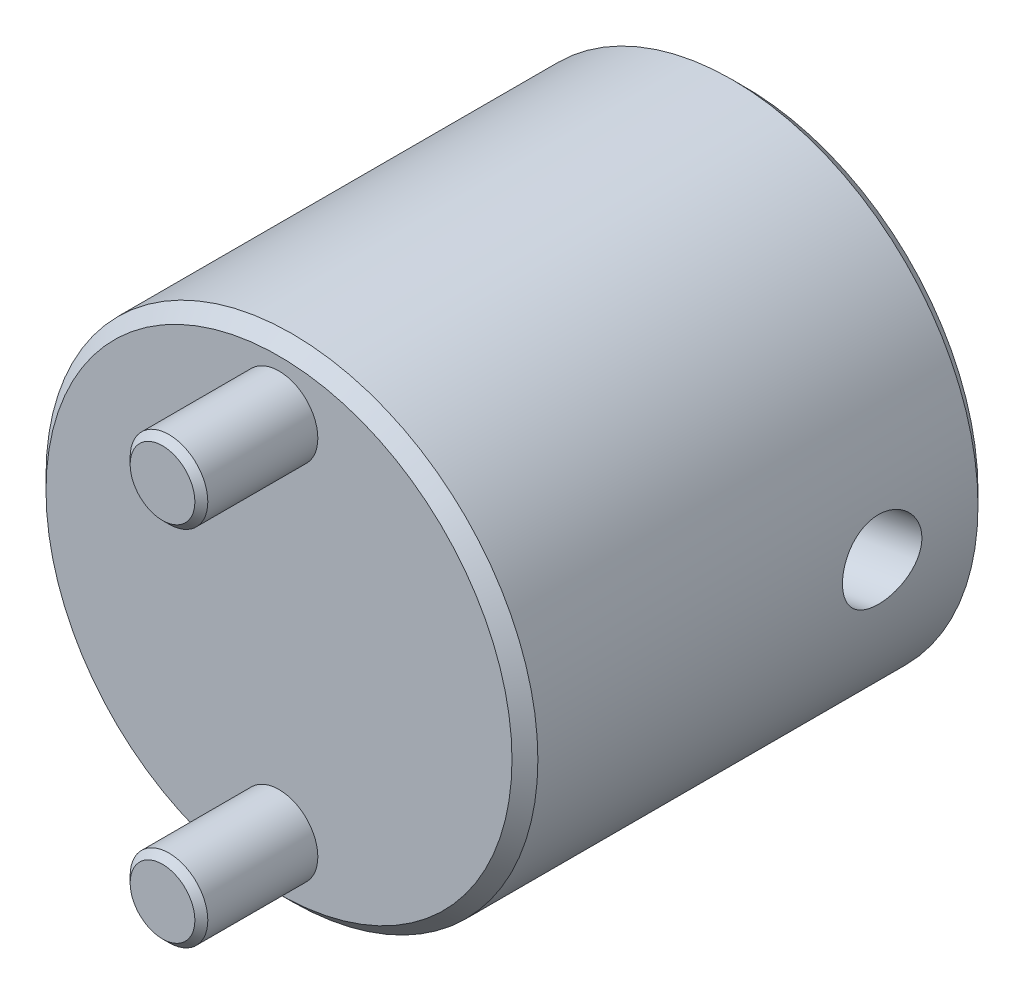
ISO-10303-21;
HEADER;
FILE_DESCRIPTION(('STEP AP214'),'2;1');
FILE_NAME('part.step','',(''),(''),'','','');
FILE_SCHEMA(('AUTOMOTIVE_DESIGN { 1 0 10303 214 1 1 1 1 }'));
ENDSEC;
DATA;
#1=APPLICATION_CONTEXT('core data for automotive mechanical design processes');
#2=APPLICATION_PROTOCOL_DEFINITION('international standard','automotive_design',2000,#1);
#3=PRODUCT_CONTEXT('',#1,'mechanical');
#4=PRODUCT('Part','Part','',(#3));
#5=PRODUCT_RELATED_PRODUCT_CATEGORY('part','',(#4));
#6=PRODUCT_DEFINITION_FORMATION('','',#4);
#7=PRODUCT_DEFINITION_CONTEXT('part definition',#1,'design');
#8=PRODUCT_DEFINITION('design','',#6,#7);
#9=PRODUCT_DEFINITION_SHAPE('','',#8);
#10=(LENGTH_UNIT() NAMED_UNIT(*) SI_UNIT(.MILLI.,.METRE.));
#11=(NAMED_UNIT(*) PLANE_ANGLE_UNIT() SI_UNIT($,.RADIAN.));
#12=(NAMED_UNIT(*) SI_UNIT($,.STERADIAN.) SOLID_ANGLE_UNIT());
#13=UNCERTAINTY_MEASURE_WITH_UNIT(LENGTH_MEASURE(1.E-05),#10,'distance_accuracy_value','');
#14=(GEOMETRIC_REPRESENTATION_CONTEXT(3) GLOBAL_UNCERTAINTY_ASSIGNED_CONTEXT((#13)) GLOBAL_UNIT_ASSIGNED_CONTEXT((#10,
#11,#12)) REPRESENTATION_CONTEXT('',''));
#15=CARTESIAN_POINT('',(0.,0.,0.));
#16=DIRECTION('',(0.,0.,1.));
#17=DIRECTION('',(1.,0.,0.));
#18=AXIS2_PLACEMENT_3D('',#15,#16,#17);
#19=CARTESIAN_POINT('',(0.,0.,9.));
#20=DIRECTION('',(0.,0.,1.));
#21=DIRECTION('',(1.,0.,0.));
#22=AXIS2_PLACEMENT_3D('',#19,#20,#21);
#23=PLANE('',#22);
#24=CARTESIAN_POINT('',(0.,14.,9.));
#25=DIRECTION('',(0.,0.,1.));
#26=DIRECTION('',(1.,0.,0.));
#27=AXIS2_PLACEMENT_3D('',#24,#25,#26);
#28=CIRCLE('',#27,2.49998893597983);
#29=CARTESIAN_POINT('',(2.49998893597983,14.,9.));
#30=VERTEX_POINT('',#29);
#31=EDGE_CURVE('E17',#30,#30,#28,.F.);
#32=ORIENTED_EDGE('',*,*,#31,.F.);
#33=EDGE_LOOP('',(#32));
#34=FACE_BOUND('',#33,.T.);
#35=ADVANCED_FACE('F14',(#34),#23,.T.);
#36=CARTESIAN_POINT('',(0.,0.,9.));
#37=DIRECTION('',(0.,0.,1.));
#38=DIRECTION('',(1.,0.,0.));
#39=AXIS2_PLACEMENT_3D('',#36,#37,#38);
#40=PLANE('',#39);
#41=CARTESIAN_POINT('',(0.,-14.,9.));
#42=DIRECTION('',(0.,0.,1.));
#43=DIRECTION('',(1.,0.,0.));
#44=AXIS2_PLACEMENT_3D('',#41,#42,#43);
#45=CIRCLE('',#44,2.49998893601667);
#46=CARTESIAN_POINT('',(2.49998893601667,-14.,9.));
#47=VERTEX_POINT('',#46);
#48=EDGE_CURVE('E114',#47,#47,#45,.F.);
#49=ORIENTED_EDGE('',*,*,#48,.F.);
#50=EDGE_LOOP('',(#49));
#51=FACE_BOUND('',#50,.T.);
#52=ADVANCED_FACE('F104',(#51),#40,.T.);
#53=CARTESIAN_POINT('',(2.237350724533,0.,-6.655571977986));
#54=DIRECTION('',(0.207911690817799,0.,0.978147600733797));
#55=DIRECTION('',(0.978147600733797,0.,-0.207911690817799));
#56=AXIS2_PLACEMENT_3D('',#53,#54,#55);
#57=PLANE('',#56);
#58=CARTESIAN_POINT('',(2.23735072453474,0.,-6.65557197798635));
#59=DIRECTION('',(0.207911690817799,0.,0.978147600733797));
#60=DIRECTION('',(0.978147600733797,0.,-0.207911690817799));
#61=AXIS2_PLACEMENT_3D('',#58,#59,#60);
#62=CIRCLE('',#61,10.);
#63=CARTESIAN_POINT('',(12.0188267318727,0.,-8.73468888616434));
#64=VERTEX_POINT('',#63);
#65=EDGE_CURVE('E116',#64,#64,#62,.F.);
#66=ORIENTED_EDGE('',*,*,#65,.T.);
#67=EDGE_LOOP('',(#66));
#68=FACE_BOUND('',#67,.T.);
#69=ADVANCED_FACE('F101',(#68),#57,.F.);
#70=CARTESIAN_POINT('',(0.,14.,8.49999144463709));
#71=DIRECTION('',(0.,0.,-1.));
#72=DIRECTION('',(-1.,0.,0.));
#73=AXIS2_PLACEMENT_3D('',#70,#71,#72);
#74=CONICAL_SURFACE('',#73,2.99999527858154,0.785395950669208);
#75=CARTESIAN_POINT('',(0.,14.,8.49998672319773));
#76=DIRECTION('',(0.,0.,-1.));
#77=DIRECTION('',(-1.,0.,0.));
#78=AXIS2_PLACEMENT_3D('',#75,#76,#77);
#79=CIRCLE('',#78,3.);
#80=CARTESIAN_POINT('',(-3.,14.,8.49998672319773));
#81=VERTEX_POINT('',#80);
#82=EDGE_CURVE('E118',#81,#81,#79,.T.);
#83=ORIENTED_EDGE('',*,*,#82,.F.);
#84=EDGE_LOOP('',(#83));
#85=FACE_BOUND('',#84,.T.);
#86=ORIENTED_EDGE('',*,*,#31,.T.);
#87=EDGE_LOOP('',(#86));
#88=FACE_BOUND('',#87,.T.);
#89=ADVANCED_FACE('F97',(#85,#88),#74,.T.);
#90=CARTESIAN_POINT('',(0.,-14.,8.49999144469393));
#91=DIRECTION('',(0.,0.,-1.));
#92=DIRECTION('',(-1.,0.,0.));
#93=AXIS2_PLACEMENT_3D('',#90,#91,#92);
#94=CONICAL_SURFACE('',#93,2.99999527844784,0.785395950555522);
#95=CARTESIAN_POINT('',(0.,-14.,8.49998672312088));
#96=DIRECTION('',(0.,0.,-1.));
#97=DIRECTION('',(-1.,0.,0.));
#98=AXIS2_PLACEMENT_3D('',#95,#96,#97);
#99=CIRCLE('',#98,3.);
#100=CARTESIAN_POINT('',(-3.,-14.,8.49998672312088));
#101=VERTEX_POINT('',#100);
#102=EDGE_CURVE('E123',#101,#101,#99,.T.);
#103=ORIENTED_EDGE('',*,*,#102,.F.);
#104=EDGE_LOOP('',(#103));
#105=FACE_BOUND('',#104,.T.);
#106=ORIENTED_EDGE('',*,*,#48,.T.);
#107=EDGE_LOOP('',(#106));
#108=FACE_BOUND('',#107,.T.);
#109=ADVANCED_FACE('F92',(#105,#108),#94,.T.);
#110=CARTESIAN_POINT('',(-6.9600494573,0.,-49.92593780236));
#111=DIRECTION('',(0.207911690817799,0.,0.978147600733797));
#112=DIRECTION('',(0.978147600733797,0.,-0.207911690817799));
#113=AXIS2_PLACEMENT_3D('',#110,#111,#112);
#114=CYLINDRICAL_SURFACE('',#113,10.);
#115=CARTESIAN_POINT('',(-3.99999999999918,0.,-36.));
#116=DIRECTION('',(0.,0.,-1.));
#117=DIRECTION('',(1.,0.,0.));
#118=AXIS2_PLACEMENT_3D('',#115,#116,#117);
#119=ELLIPSE('',#118,10.2234059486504,10.);
#120=CARTESIAN_POINT('',(6.2234059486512,0.,-36.));
#121=VERTEX_POINT('',#120);
#122=EDGE_CURVE('E79',#121,#121,#119,.F.);
#123=ORIENTED_EDGE('',*,*,#122,.F.);
#124=EDGE_LOOP('',(#123));
#125=FACE_BOUND('',#124,.T.);
#126=ORIENTED_EDGE('',*,*,#65,.F.);
#127=EDGE_LOOP('',(#126));
#128=FACE_BOUND('',#127,.T.);
#129=CARTESIAN_POINT('',(7.86059291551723,0.,-28.2976409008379));
#130=CARTESIAN_POINT('',(7.86058897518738,0.16436423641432,-28.2976309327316));
#131=CARTESIAN_POINT('',(7.85940691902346,0.328908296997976,-28.283516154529));
#132=CARTESIAN_POINT('',(7.85500093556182,0.653366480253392,-28.2275650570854));
#133=CARTESIAN_POINT('',(7.85177341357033,0.813271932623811,-28.1856799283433));
#134=CARTESIAN_POINT('',(7.84424745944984,1.12348315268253,-28.0758960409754));
#135=CARTESIAN_POINT('',(7.83995123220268,1.27380789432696,-28.008050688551));
#136=CARTESIAN_POINT('',(7.83173103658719,1.56129290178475,-27.8487307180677));
#137=CARTESIAN_POINT('',(7.82780700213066,1.69845550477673,-27.7572603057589));
#138=CARTESIAN_POINT('',(7.82203030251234,1.95973946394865,-27.5508590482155));
#139=CARTESIAN_POINT('',(7.8202341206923,2.08342924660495,-27.4353802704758));
#140=CARTESIAN_POINT('',(7.8209891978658,2.31049290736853,-27.1859013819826));
#141=CARTESIAN_POINT('',(7.82354142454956,2.41386225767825,-27.0518971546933));
#142=CARTESIAN_POINT('',(7.83517752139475,2.59960101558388,-26.7659435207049));
#143=CARTESIAN_POINT('',(7.84440678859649,2.68144668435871,-26.613658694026));
#144=CARTESIAN_POINT('',(7.87140506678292,2.81842825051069,-26.2982171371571));
#145=CARTESIAN_POINT('',(7.88917197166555,2.87357072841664,-26.1350630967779));
#146=CARTESIAN_POINT('',(7.93370640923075,2.95403265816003,-25.8076492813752));
#147=CARTESIAN_POINT('',(7.96020800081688,2.98014390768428,-25.6435483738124));
#148=CARTESIAN_POINT('',(8.02230446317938,3.00427461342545,-25.315018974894));
#149=CARTESIAN_POINT('',(8.05789713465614,3.00230085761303,-25.1505905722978));
#150=CARTESIAN_POINT('',(8.13557748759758,2.9709395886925,-24.8323204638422));
#151=CARTESIAN_POINT('',(8.17738431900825,2.94254427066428,-24.6783108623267));
#152=CARTESIAN_POINT('',(8.26641349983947,2.86074869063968,-24.3787396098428));
#153=CARTESIAN_POINT('',(8.31363641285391,2.80734582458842,-24.2331788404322));
#154=CARTESIAN_POINT('',(8.41159148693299,2.67631861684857,-23.9520328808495));
#155=CARTESIAN_POINT('',(8.46236292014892,2.59837186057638,-23.8166120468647));
#156=CARTESIAN_POINT('',(8.56381185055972,2.42069837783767,-23.5608667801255));
#157=CARTESIAN_POINT('',(8.61448932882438,2.32096766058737,-23.4405451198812));
#158=CARTESIAN_POINT('',(8.71468072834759,2.09764727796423,-23.2127491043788));
#159=CARTESIAN_POINT('',(8.76405853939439,1.97323765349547,-23.1060174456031));
#160=CARTESIAN_POINT('',(8.85593041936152,1.7065766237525,-22.9138605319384));
#161=CARTESIAN_POINT('',(8.89842152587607,1.56431758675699,-22.8284444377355));
#162=CARTESIAN_POINT('',(8.9736634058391,1.26458300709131,-22.6805221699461));
#163=CARTESIAN_POINT('',(9.00633959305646,1.10700242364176,-22.6181906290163));
#164=CARTESIAN_POINT('',(9.05886880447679,0.782158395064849,-22.5192306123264));
#165=CARTESIAN_POINT('',(9.07874827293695,0.614915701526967,-22.4825491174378));
#166=CARTESIAN_POINT('',(9.09695344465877,0.371824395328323,-22.449084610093));
#167=CARTESIAN_POINT('',(9.10111089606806,0.297737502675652,-22.4414687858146));
#168=CARTESIAN_POINT('',(9.10666744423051,0.149112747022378,-22.4313024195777));
#169=CARTESIAN_POINT('',(9.10806653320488,0.0745748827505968,-22.4287518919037));
#170=CARTESIAN_POINT('',(9.10805540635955,-0.164364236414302,-22.4287628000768));
#171=CARTESIAN_POINT('',(9.10123454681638,-0.328908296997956,-22.4411765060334));
#172=CARTESIAN_POINT('',(9.07445211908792,-0.653366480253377,-22.4904983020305));
#173=CARTESIAN_POINT('',(9.05446741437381,-0.813271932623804,-22.5274495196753));
#174=CARTESIAN_POINT('',(9.00293898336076,-1.12348315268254,-22.6246810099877));
#175=CARTESIAN_POINT('',(8.97141899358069,-1.27380789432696,-22.6849133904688));
#176=CARTESIAN_POINT('',(8.89910820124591,-1.56129290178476,-22.8271159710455));
#177=CARTESIAN_POINT('',(8.85831904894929,-1.69845550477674,-22.9090823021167));
#178=CARTESIAN_POINT('',(8.76909081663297,-1.95973946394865,-23.0952896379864));
#179=CARTESIAN_POINT('',(8.72048047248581,-2.08342924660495,-23.2000541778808));
#180=CARTESIAN_POINT('',(8.6196980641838,-2.31049290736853,-23.4282716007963));
#181=CARTESIAN_POINT('',(8.56752520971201,-2.41386225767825,-23.551728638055));
#182=CARTESIAN_POINT('',(8.46184749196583,-2.59960101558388,-23.8176931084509));
#183=CARTESIAN_POINT('',(8.40833902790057,-2.68144668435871,-23.960566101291));
#184=CARTESIAN_POINT('',(8.30470154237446,-2.81842825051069,-24.2597174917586));
#185=CARTESIAN_POINT('',(8.25457169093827,-2.87357072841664,-24.4159925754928));
#186=CARTESIAN_POINT('',(8.16208472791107,-2.95403265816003,-24.7332137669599));
#187=CARTESIAN_POINT('',(8.11954928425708,-2.98014390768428,-24.8939065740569));
#188=CARTESIAN_POINT('',(8.04265228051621,-3.00427461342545,-25.219290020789));
#189=CARTESIAN_POINT('',(8.00828874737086,-3.00230085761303,-25.3839796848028));
#190=CARTESIAN_POINT('',(7.94980116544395,-2.9709395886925,-25.7063293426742));
#191=CARTESIAN_POINT('',(7.92535225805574,-2.94254427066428,-25.8640284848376));
#192=CARTESIAN_POINT('',(7.88483785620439,-2.86074869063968,-26.1739118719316));
#193=CARTESIAN_POINT('',(7.86877323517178,-2.80734582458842,-26.3260955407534));
#194=CARTESIAN_POINT('',(7.84390728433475,-2.67631861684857,-26.6227770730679));
#195=CARTESIAN_POINT('',(7.83520868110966,-2.59837186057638,-26.7671407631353));
#196=CARTESIAN_POINT('',(7.8238659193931,-2.42069837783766,-27.0420386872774));
#197=CARTESIAN_POINT('',(7.82122287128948,-2.32096766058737,-27.1725703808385));
#198=CARTESIAN_POINT('',(7.82009928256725,-2.09764727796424,-27.4214239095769));
#199=CARTESIAN_POINT('',(7.82179648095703,-1.97323765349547,-27.5390118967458));
#200=CARTESIAN_POINT('',(7.82756836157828,-1.7065766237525,-27.7519236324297));
#201=CARTESIAN_POINT('',(7.83164406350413,-1.56431758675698,-27.8472378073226));
#202=CARTESIAN_POINT('',(7.84021553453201,-1.26458300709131,-28.0129751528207));
#203=CARTESIAN_POINT('',(7.84471419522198,-1.10700242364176,-28.0832084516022));
#204=CARTESIAN_POINT('',(7.85245135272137,-0.782158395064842,-28.1949784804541));
#205=CARTESIAN_POINT('',(7.8556924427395,-0.614915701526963,-28.2365744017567));
#206=CARTESIAN_POINT('',(7.85871245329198,-0.371824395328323,-28.2745504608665));
#207=CARTESIAN_POINT('',(7.85941283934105,-0.297737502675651,-28.2831988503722));
#208=CARTESIAN_POINT('',(7.86035396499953,-0.149112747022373,-28.2947463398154));
#209=CARTESIAN_POINT('',(7.8605947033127,-0.0745748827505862,-28.2976454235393));
#210=CARTESIAN_POINT('',(7.86059291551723,0.,-28.2976409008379));
#211=B_SPLINE_CURVE_WITH_KNOTS('',3,(#129,#130,#131,#132,#133,#134,#135,#136,#137,#138,#139,
#140,#141,#142,#143,#144,#145,#146,#147,#148,#149,#150,#151,#152,#153,#154,#155,#156,#157,#158,
#159,#160,#161,#162,#163,#164,#165,#166,#167,#168,#169,#170,#171,#172,#173,#174,#175,#176,#177,
#178,#179,#180,#181,#182,#183,#184,#185,#186,#187,#188,#189,#190,#191,#192,#193,#194,#195,#196,
#197,#198,#199,#200,#201,#202,#203,#204,#205,#206,#207,#208,#209,#210),.UNSPECIFIED.,.T.,.F.,(4,
2,2,2,2,2,2,2,2,2,2,2,2,2,2,2,2,2,2,2,2,2,2,2,2,2,2,2,2,2,2,2,2,2,2,2,2,2,2,2,4),(0.,
0.49280574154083,0.986479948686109,1.47914396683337,1.97172034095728,2.4770983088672,
2.98258875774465,3.49943124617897,4.01614630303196,4.51839363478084,5.02051957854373,
5.50451902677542,5.98856888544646,6.47926306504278,6.97004721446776,7.48124851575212,
7.99266913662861,8.507883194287,9.02202912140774,9.2456229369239,9.46921738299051,
9.96202312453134,10.4556973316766,10.9483613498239,11.4409377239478,11.9463156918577,
12.4518061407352,12.9686486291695,13.4853636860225,13.9876110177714,14.4897369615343,
14.9737364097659,15.457786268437,15.9484804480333,16.4392645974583,16.9504658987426,
17.4618865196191,17.9771005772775,18.4912465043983,18.7148403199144,18.938434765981),.UNSPECIFIED.);
#212=CARTESIAN_POINT('',(7.86059291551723,0.,-28.2976409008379));
#213=VERTEX_POINT('',#212);
#214=EDGE_CURVE('E76',#213,#213,#211,.T.);
#215=ORIENTED_EDGE('',*,*,#214,.T.);
#216=EDGE_LOOP('',(#215));
#217=FACE_BOUND('',#216,.T.);
#218=ADVANCED_FACE('F86',(#125,#128,#217),#114,.F.);
#219=CARTESIAN_POINT('',(0.,14.,0.));
#220=DIRECTION('',(0.,0.,1.));
#221=DIRECTION('',(1.,0.,0.));
#222=AXIS2_PLACEMENT_3D('',#219,#220,#221);
#223=CYLINDRICAL_SURFACE('',#222,3.);
#224=CARTESIAN_POINT('',(0.,14.,0.));
#225=DIRECTION('',(0.,0.,1.));
#226=DIRECTION('',(1.,0.,0.));
#227=AXIS2_PLACEMENT_3D('',#224,#225,#226);
#228=CIRCLE('',#227,3.);
#229=CARTESIAN_POINT('',(3.,14.,0.));
#230=VERTEX_POINT('',#229);
#231=EDGE_CURVE('E72',#230,#230,#228,.T.);
#232=ORIENTED_EDGE('',*,*,#231,.T.);
#233=EDGE_LOOP('',(#232));
#234=FACE_BOUND('',#233,.T.);
#235=ORIENTED_EDGE('',*,*,#82,.T.);
#236=EDGE_LOOP('',(#235));
#237=FACE_BOUND('',#236,.T.);
#238=ADVANCED_FACE('F91',(#234,#237),#223,.T.);
#239=CARTESIAN_POINT('',(0.,-14.,0.));
#240=DIRECTION('',(0.,0.,1.));
#241=DIRECTION('',(1.,0.,0.));
#242=AXIS2_PLACEMENT_3D('',#239,#240,#241);
#243=CYLINDRICAL_SURFACE('',#242,3.);
#244=CARTESIAN_POINT('',(0.,-14.,0.));
#245=DIRECTION('',(0.,0.,1.));
#246=DIRECTION('',(1.,0.,0.));
#247=AXIS2_PLACEMENT_3D('',#244,#245,#246);
#248=CIRCLE('',#247,3.);
#249=CARTESIAN_POINT('',(3.,-14.,0.));
#250=VERTEX_POINT('',#249);
#251=EDGE_CURVE('E68',#250,#250,#248,.T.);
#252=ORIENTED_EDGE('',*,*,#251,.T.);
#253=EDGE_LOOP('',(#252));
#254=FACE_BOUND('',#253,.T.);
#255=ORIENTED_EDGE('',*,*,#102,.T.);
#256=EDGE_LOOP('',(#255));
#257=FACE_BOUND('',#256,.T.);
#258=ADVANCED_FACE('F139',(#254,#257),#243,.T.);
#259=CARTESIAN_POINT('',(0.,0.,-36.));
#260=DIRECTION('',(0.,0.,-1.));
#261=DIRECTION('',(-1.,0.,0.));
#262=AXIS2_PLACEMENT_3D('',#259,#260,#261);
#263=PLANE('',#262);
#264=ORIENTED_EDGE('',*,*,#122,.T.);
#265=EDGE_LOOP('',(#264));
#266=FACE_BOUND('',#265,.T.);
#267=CARTESIAN_POINT('',(0.,0.,-36.));
#268=DIRECTION('',(0.,0.,-1.));
#269=DIRECTION('',(-1.,0.,0.));
#270=AXIS2_PLACEMENT_3D('',#267,#268,#269);
#271=CIRCLE('',#270,17.9999935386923);
#272=CARTESIAN_POINT('',(-17.9999935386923,0.,-36.));
#273=VERTEX_POINT('',#272);
#274=EDGE_CURVE('E38',#273,#273,#271,.F.);
#275=ORIENTED_EDGE('',*,*,#274,.F.);
#276=EDGE_LOOP('',(#275));
#277=FACE_BOUND('',#276,.T.);
#278=ADVANCED_FACE('F63',(#266,#277),#263,.T.);
#279=CARTESIAN_POINT('',(-6.013494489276,0.,-22.28159080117));
#280=DIRECTION('',(0.978147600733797,0.,-0.207911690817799));
#281=DIRECTION('',(-0.207911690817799,0.,-0.978147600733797));
#282=AXIS2_PLACEMENT_3D('',#279,#280,#281);
#283=CYLINDRICAL_SURFACE('',#282,3.);
#284=ORIENTED_EDGE('',*,*,#214,.F.);
#285=EDGE_LOOP('',(#284));
#286=FACE_BOUND('',#285,.T.);
#287=CARTESIAN_POINT('',(19.,0.,-24.5313514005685));
#288=CARTESIAN_POINT('',(18.9999968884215,0.168060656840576,-24.5313585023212));
#289=CARTESIAN_POINT('',(18.9977454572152,0.336324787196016,-24.5453666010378));
#290=CARTESIAN_POINT('',(18.9889720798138,0.668310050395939,-24.6011107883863));
#291=CARTESIAN_POINT('',(18.9824418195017,0.832021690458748,-24.6429008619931));
#292=CARTESIAN_POINT('',(18.9658371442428,1.14992778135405,-24.7531288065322));
#293=CARTESIAN_POINT('',(18.9557651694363,1.30412869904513,-24.8215483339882));
#294=CARTESIAN_POINT('',(18.9332033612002,1.59863957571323,-24.983196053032));
#295=CARTESIAN_POINT('',(18.920714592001,1.73895560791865,-25.0764133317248));
#296=CARTESIAN_POINT('',(18.8947353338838,2.0015987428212,-25.2850039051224));
#297=CARTESIAN_POINT('',(18.8812462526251,2.12395042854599,-25.4003464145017));
#298=CARTESIAN_POINT('',(18.8547663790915,2.34744205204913,-25.6500756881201));
#299=CARTESIAN_POINT('',(18.8417756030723,2.44858129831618,-25.7844630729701));
#300=CARTESIAN_POINT('',(18.8177784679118,2.6266514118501,-26.068107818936));
#301=CARTESIAN_POINT('',(18.8067673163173,2.70364108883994,-26.2173278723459));
#302=CARTESIAN_POINT('',(18.7878969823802,2.83180978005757,-26.5266407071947));
#303=CARTESIAN_POINT('',(18.7800377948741,2.88298883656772,-26.6867334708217));
#304=CARTESIAN_POINT('',(18.7682572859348,2.95871782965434,-27.0143025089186));
#305=CARTESIAN_POINT('',(18.7643614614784,2.98309542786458,-27.1818194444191));
#306=CARTESIAN_POINT('',(18.7609578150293,3.00442603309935,-27.518625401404));
#307=CARTESIAN_POINT('',(18.7614505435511,3.00137559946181,-27.6879146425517));
#308=CARTESIAN_POINT('',(18.766764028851,2.96797202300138,-28.0278094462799));
#309=CARTESIAN_POINT('',(18.7716884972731,2.93696459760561,-28.1983488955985));
#310=CARTESIAN_POINT('',(18.785404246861,2.84791090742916,-28.5320621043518));
#311=CARTESIAN_POINT('',(18.7941963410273,2.7898589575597,-28.6952343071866));
#312=CARTESIAN_POINT('',(18.8149703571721,2.64618592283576,-29.0147485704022));
#313=CARTESIAN_POINT('',(18.8270408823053,2.55978257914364,-29.1707337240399));
#314=CARTESIAN_POINT('',(18.8528505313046,2.36218685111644,-29.4659879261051));
#315=CARTESIAN_POINT('',(18.8665897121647,2.2509936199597,-29.6052564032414));
#316=CARTESIAN_POINT('',(18.8942101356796,2.00600000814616,-29.8633468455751));
#317=CARTESIAN_POINT('',(18.90809172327,1.87211323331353,-29.9820870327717));
#318=CARTESIAN_POINT('',(18.934285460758,1.58541320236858,-30.1943276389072));
#319=CARTESIAN_POINT('',(18.946597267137,1.43259581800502,-30.2878225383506));
#320=CARTESIAN_POINT('',(18.9676565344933,1.11875871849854,-30.4425482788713));
#321=CARTESIAN_POINT('',(18.9765282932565,0.958322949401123,-30.5049337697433));
#322=CARTESIAN_POINT('',(18.9868518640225,0.711539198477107,-30.5763650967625));
#323=CARTESIAN_POINT('',(18.9897947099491,0.628315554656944,-30.5964781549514));
#324=CARTESIAN_POINT('',(18.9946064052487,0.460386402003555,-30.6291717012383));
#325=CARTESIAN_POINT('',(18.9964758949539,0.375681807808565,-30.6417566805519));
#326=CARTESIAN_POINT('',(18.9985160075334,0.242330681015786,-30.655459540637));
#327=CARTESIAN_POINT('',(18.9990717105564,0.193942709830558,-30.6591829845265));
#328=CARTESIAN_POINT('',(18.9998141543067,0.0970435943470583,-30.6641521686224));
#329=CARTESIAN_POINT('',(19.0000008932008,0.0485324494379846,-30.665397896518));
#330=CARTESIAN_POINT('',(18.9999970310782,-0.161317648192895,-30.6653852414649));
#331=CARTESIAN_POINT('',(18.9979210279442,-0.322870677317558,-30.6515798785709));
#332=CARTESIAN_POINT('',(18.9898416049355,-0.641437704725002,-30.596868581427));
#333=CARTESIAN_POINT('',(18.9838294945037,-0.798440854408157,-30.555902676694));
#334=CARTESIAN_POINT('',(18.9685727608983,-1.10291739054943,-30.4486293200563));
#335=CARTESIAN_POINT('',(18.9593362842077,-1.2504136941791,-30.3823856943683));
#336=CARTESIAN_POINT('',(18.9386233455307,-1.53250848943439,-30.2270000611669));
#337=CARTESIAN_POINT('',(18.9271475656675,-1.66711089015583,-30.137865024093));
#338=CARTESIAN_POINT('',(18.9027258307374,-1.92464322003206,-29.9362688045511));
#339=CARTESIAN_POINT('',(18.8897439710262,-2.04704465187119,-29.8231377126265));
#340=CARTESIAN_POINT('',(18.8639742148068,-2.27230288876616,-29.5788189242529));
#341=CARTESIAN_POINT('',(18.8511863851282,-2.37515309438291,-29.4476251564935));
#342=CARTESIAN_POINT('',(18.826438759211,-2.56413753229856,-29.1630879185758));
#343=CARTESIAN_POINT('',(18.8145622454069,-2.64905309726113,-29.0089263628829));
#344=CARTESIAN_POINT('',(18.7937956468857,-2.79258421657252,-28.6886059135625));
#345=CARTESIAN_POINT('',(18.7849060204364,-2.85119573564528,-28.5224451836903));
#346=CARTESIAN_POINT('',(18.7710091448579,-2.94131995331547,-28.1790702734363));
#347=CARTESIAN_POINT('',(18.7660856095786,-2.97224979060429,-28.0016989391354));
#348=CARTESIAN_POINT('',(18.7610920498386,-3.00361307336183,-27.6442030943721));
#349=CARTESIAN_POINT('',(18.7610214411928,-3.0040501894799,-27.464078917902));
#350=CARTESIAN_POINT('',(18.7657779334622,-2.97418777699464,-27.1101073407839));
#351=CARTESIAN_POINT('',(18.7705062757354,-2.94450803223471,-26.9362066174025));
#352=CARTESIAN_POINT('',(18.7842171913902,-2.85572863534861,-26.5962576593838));
#353=CARTESIAN_POINT('',(18.7931990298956,-2.79663406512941,-26.4302080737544));
#354=CARTESIAN_POINT('',(18.814043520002,-2.65270674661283,-26.116041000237));
#355=CARTESIAN_POINT('',(18.8258094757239,-2.56871805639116,-25.9675299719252));
#356=CARTESIAN_POINT('',(18.8510118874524,-2.37669719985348,-25.6871412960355));
#357=CARTESIAN_POINT('',(18.864448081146,-2.26866880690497,-25.5552610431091));
#358=CARTESIAN_POINT('',(18.8912419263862,-2.03340931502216,-25.3137598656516));
#359=CARTESIAN_POINT('',(18.9045977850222,-1.90648693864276,-25.2038376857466));
#360=CARTESIAN_POINT('',(18.9299384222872,-1.63581033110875,-25.0068086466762));
#361=CARTESIAN_POINT('',(18.9419226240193,-1.49204906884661,-24.9197113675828));
#362=CARTESIAN_POINT('',(18.9631852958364,-1.19175300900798,-24.7706758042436));
#363=CARTESIAN_POINT('',(18.9724619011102,-1.03520950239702,-24.7087548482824));
#364=CARTESIAN_POINT('',(18.9872548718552,-0.714048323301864,-24.6118622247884));
#365=CARTESIAN_POINT('',(18.9927784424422,-0.549446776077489,-24.5768389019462));
#366=CARTESIAN_POINT('',(18.9974175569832,-0.319699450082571,-24.5475611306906));
#367=CARTESIAN_POINT('',(18.9983838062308,-0.255923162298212,-24.541486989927));
#368=CARTESIAN_POINT('',(18.9996756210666,-0.12810777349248,-24.533380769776));
#369=CARTESIAN_POINT('',(19.0000011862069,-0.0640686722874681,-24.5313486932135));
#370=CARTESIAN_POINT('',(19.,0.,-24.5313514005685));
#371=B_SPLINE_CURVE_WITH_KNOTS('',3,(#287,#288,#289,#290,#291,#292,#293,#294,#295,#296,#297,
#298,#299,#300,#301,#302,#303,#304,#305,#306,#307,#308,#309,#310,#311,#312,#313,#314,#315,#316,
#317,#318,#319,#320,#321,#322,#323,#324,#325,#326,#327,#328,#329,#330,#331,#332,#333,#334,#335,
#336,#337,#338,#339,#340,#341,#342,#343,#344,#345,#346,#347,#348,#349,#350,#351,#352,#353,#354,
#355,#356,#357,#358,#359,#360,#361,#362,#363,#364,#365,#366,#367,#368,#369,#370),.UNSPECIFIED.,
.T.,.F.,(4,2,2,2,2,2,2,2,2,2,2,2,2,2,2,2,2,2,2,2,2,2,2,2,2,2,2,2,2,2,2,2,2,2,2,2,2,2,2,2,2,4),
(0.,0.503941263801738,1.00886464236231,1.51344082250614,2.01779531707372,2.52145307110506,
3.02512724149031,3.52756515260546,4.03000224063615,4.53565153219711,5.04136425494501,
5.55922850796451,6.07720167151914,6.61087396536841,7.14456449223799,7.68033438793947,
8.21622132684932,8.73037639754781,8.98710134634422,9.24367298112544,9.3892143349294,
9.53475641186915,10.0185256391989,10.5033666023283,10.986991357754,11.4704690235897,
11.9698243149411,12.4693478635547,12.9961339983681,13.5230009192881,14.0607168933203,
14.5983681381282,15.1251748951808,15.6518906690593,16.1624685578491,16.6729663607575,
17.1758892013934,17.6790227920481,18.1825020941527,18.6850120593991,18.8771261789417,
19.0692404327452),.UNSPECIFIED.);
#372=CARTESIAN_POINT('',(19.,0.,-24.5313514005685));
#373=VERTEX_POINT('',#372);
#374=EDGE_CURVE('E31',#373,#373,#371,.T.);
#375=ORIENTED_EDGE('',*,*,#374,.F.);
#376=EDGE_LOOP('',(#375));
#377=FACE_BOUND('',#376,.T.);
#378=ADVANCED_FACE('F40',(#286,#377),#283,.F.);
#379=CARTESIAN_POINT('',(0.,0.,0.));
#380=DIRECTION('',(0.,0.,-1.));
#381=DIRECTION('',(-1.,0.,0.));
#382=AXIS2_PLACEMENT_3D('',#379,#380,#381);
#383=PLANE('',#382);
#384=ORIENTED_EDGE('',*,*,#251,.F.);
#385=EDGE_LOOP('',(#384));
#386=FACE_BOUND('',#385,.T.);
#387=ORIENTED_EDGE('',*,*,#231,.F.);
#388=EDGE_LOOP('',(#387));
#389=FACE_BOUND('',#388,.T.);
#390=CARTESIAN_POINT('',(0.,0.,0.));
#391=DIRECTION('',(0.,0.,-1.));
#392=DIRECTION('',(-1.,0.,0.));
#393=AXIS2_PLACEMENT_3D('',#390,#391,#392);
#394=CIRCLE('',#393,17.9999934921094);
#395=CARTESIAN_POINT('',(-17.9999934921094,0.,0.));
#396=VERTEX_POINT('',#395);
#397=EDGE_CURVE('E26',#396,#396,#394,.T.);
#398=ORIENTED_EDGE('',*,*,#397,.F.);
#399=EDGE_LOOP('',(#398));
#400=FACE_BOUND('',#399,.T.);
#401=ADVANCED_FACE('F55',(#386,#389,#400),#383,.F.);
#402=CARTESIAN_POINT('',(0.,0.,-34.99999620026));
#403=DIRECTION('',(0.,0.,1.));
#404=DIRECTION('',(1.,0.,0.));
#405=AXIS2_PLACEMENT_3D('',#402,#403,#404);
#406=CONICAL_SURFACE('',#405,18.9999969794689,0.785397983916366);
#407=ORIENTED_EDGE('',*,*,#274,.T.);
#408=EDGE_LOOP('',(#407));
#409=FACE_BOUND('',#408,.T.);
#410=CARTESIAN_POINT('',(0.,0.,-34.99999922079));
#411=DIRECTION('',(0.,0.,-1.));
#412=DIRECTION('',(-1.,0.,0.));
#413=AXIS2_PLACEMENT_3D('',#410,#411,#412);
#414=CIRCLE('',#413,19.);
#415=CARTESIAN_POINT('',(-19.,0.,-34.99999922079));
#416=VERTEX_POINT('',#415);
#417=EDGE_CURVE('E21',#416,#416,#414,.F.);
#418=ORIENTED_EDGE('',*,*,#417,.F.);
#419=EDGE_LOOP('',(#418));
#420=FACE_BOUND('',#419,.T.);
#421=ADVANCED_FACE('F52',(#409,#420),#406,.T.);
#422=CARTESIAN_POINT('',(0.,0.,-1.00000391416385));
#423=DIRECTION('',(0.,0.,-1.));
#424=DIRECTION('',(-1.,0.,0.));
#425=AXIS2_PLACEMENT_3D('',#422,#423,#424);
#426=CONICAL_SURFACE('',#425,18.9999970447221,0.785397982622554);
#427=CARTESIAN_POINT('',(0.,0.,-1.000000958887));
#428=DIRECTION('',(0.,0.,-1.));
#429=DIRECTION('',(-1.,0.,0.));
#430=AXIS2_PLACEMENT_3D('',#427,#428,#429);
#431=CIRCLE('',#430,19.);
#432=CARTESIAN_POINT('',(-19.,0.,-1.000000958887));
#433=VERTEX_POINT('',#432);
#434=EDGE_CURVE('E9',#433,#433,#431,.T.);
#435=ORIENTED_EDGE('',*,*,#434,.F.);
#436=EDGE_LOOP('',(#435));
#437=FACE_BOUND('',#436,.T.);
#438=ORIENTED_EDGE('',*,*,#397,.T.);
#439=EDGE_LOOP('',(#438));
#440=FACE_BOUND('',#439,.T.);
#441=ADVANCED_FACE('F48',(#437,#440),#426,.T.);
#442=CARTESIAN_POINT('',(0.,0.,1.8));
#443=DIRECTION('',(0.,0.,-1.));
#444=DIRECTION('',(-1.,0.,0.));
#445=AXIS2_PLACEMENT_3D('',#442,#443,#444);
#446=CYLINDRICAL_SURFACE('',#445,19.);
#447=ORIENTED_EDGE('',*,*,#417,.T.);
#448=EDGE_LOOP('',(#447));
#449=FACE_BOUND('',#448,.T.);
#450=ORIENTED_EDGE('',*,*,#434,.T.);
#451=EDGE_LOOP('',(#450));
#452=FACE_BOUND('',#451,.T.);
#453=ORIENTED_EDGE('',*,*,#374,.T.);
#454=EDGE_LOOP('',(#453));
#455=FACE_BOUND('',#454,.T.);
#456=ADVANCED_FACE('F44',(#449,#452,#455),#446,.T.);
#457=CLOSED_SHELL('',(#35,#52,#69,#89,#109,#218,#238,#258,#278,#378,#401,#421,#441,#456));
#458=MANIFOLD_SOLID_BREP('B1',#457);
#459=ADVANCED_BREP_SHAPE_REPRESENTATION('',(#18,#458),#14);
#460=SHAPE_DEFINITION_REPRESENTATION(#9,#459);
ENDSEC;
END-ISO-10303-21;
